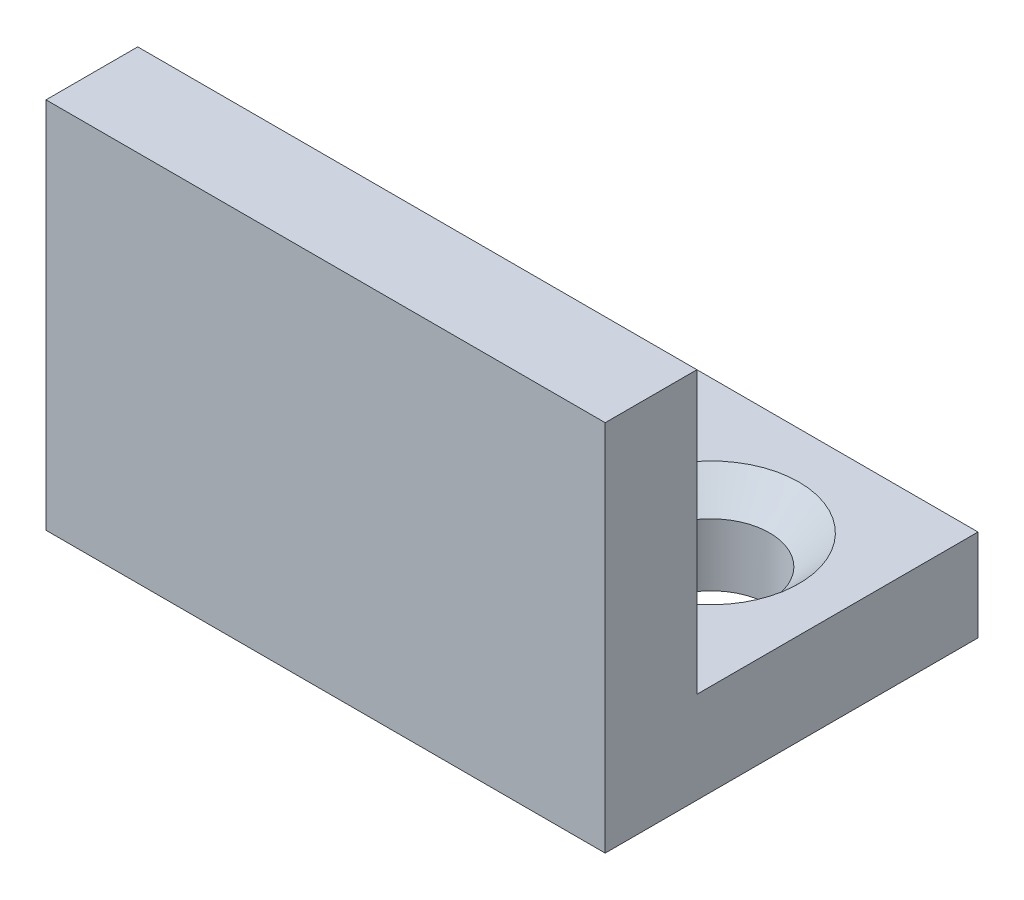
from build123d import *

# Parameters (mm, degrees)
BOSS_EXTRUDE1_DEPTH = 9.525
CUT_EXTRUDE1_REACH  = 18.556
SKETCH2_R           = 2
CHAMFER1_SIZE       = 1


with BuildPart() as part:
    # Sketch1 → Boss-Extrude1 (new, symmetric)
    with BuildSketch(Plane(origin=(0, 0, 0), x_dir=(0, 0, -1), z_dir=(1, 0, 0))):
        Polygon((0, 9.575), (0, 0), (9.575, 0), (9.575, -3.125), (-3.125, -3.125), (-3.125, 9.575), align=None)
    extrude(amount=BOSS_EXTRUDE1_DEPTH, both=True)

    # Sketch2 → Cut-Extrude1 (cut, up to next)
    with BuildSketch(Plane(origin=(0, 0, 0), x_dir=(1, 0, 0), z_dir=(0, 1, 0)), mode=Mode.PRIVATE) as cut_extrude1_sk1:
        with Locations(Location((-5, 5, 0), (0, 0, 270))):
            Circle(SKETCH2_R)
    cut_extrude1_tool1 = extrude(cut_extrude1_sk1.sketch, amount=-CUT_EXTRUDE1_REACH, mode=Mode.PRIVATE) & part.part
    # Sketch2 → Cut-Extrude1 (cut, up to next)
    with BuildSketch(Plane(origin=(0, 0, 0), x_dir=(1, 0, 0), z_dir=(0, 1, 0)), mode=Mode.PRIVATE) as cut_extrude1_sk2:
        with Locations(Location((5, 5, 0), (0, 0, 270))):
            Circle(SKETCH2_R)
    cut_extrude1_tool2 = extrude(cut_extrude1_sk2.sketch, amount=-CUT_EXTRUDE1_REACH, mode=Mode.PRIVATE) & part.part
    add(cut_extrude1_tool1.solids().sort_by_distance((-5, 0, -5))[0], mode=Mode.SUBTRACT)
    add(cut_extrude1_tool2.solids().sort_by_distance((5, 0, -5))[0], mode=Mode.SUBTRACT)

    # Chamfer1
    chamfer1_edges = [part.edges().sort_by_distance(p)[0] for p in [
        (-5, 0, -7),
        (5, 0, -7),
    ]]
    chamfer(chamfer1_edges, length=CHAMFER1_SIZE)


solid = part.part
